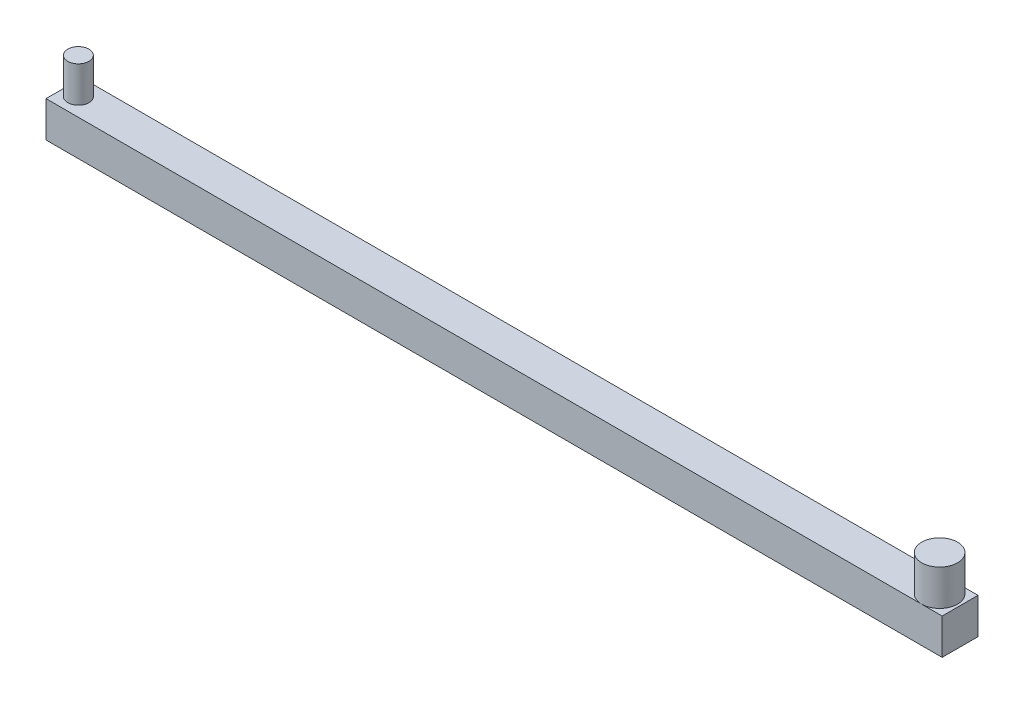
from build123d import *

# Parameters (mm, degrees)
SKETCH1_W           = 50
SKETCH1_H           = 2
BOSS_EXTRUDE1_DEPTH = 2
SKETCH3_R           = 0.59
SKETCH3_R_2         = 1
BOSS_EXTRUDE2_DEPTH = 2


with BuildPart() as part:
    # Sketch1 → Boss-Extrude1 (new body)
    with BuildSketch(Plane(origin=(0, 0, 0), x_dir=(1, 0, 0), z_dir=(0, 1, 0))):
        with Locations((1.923076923, 1.611336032)):
            Rectangle(SKETCH1_W, SKETCH1_H)
    extrude(amount=BOSS_EXTRUDE1_DEPTH)

    # Sketch3 → Boss-Extrude2 (add)
    with BuildSketch(Plane(origin=(0, 2, 0), x_dir=(1, 0, 0), z_dir=(0, 1, 0))):
        with Locations(Location((-22.269424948, 1.611336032, 0), (0, 0, 270))):
            Circle(SKETCH3_R)
        with Locations(Location((25.780575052, 1.611336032, 0), (0, 0, 270))):
            Circle(SKETCH3_R_2)
    extrude(amount=BOSS_EXTRUDE2_DEPTH)


solid = part.part
